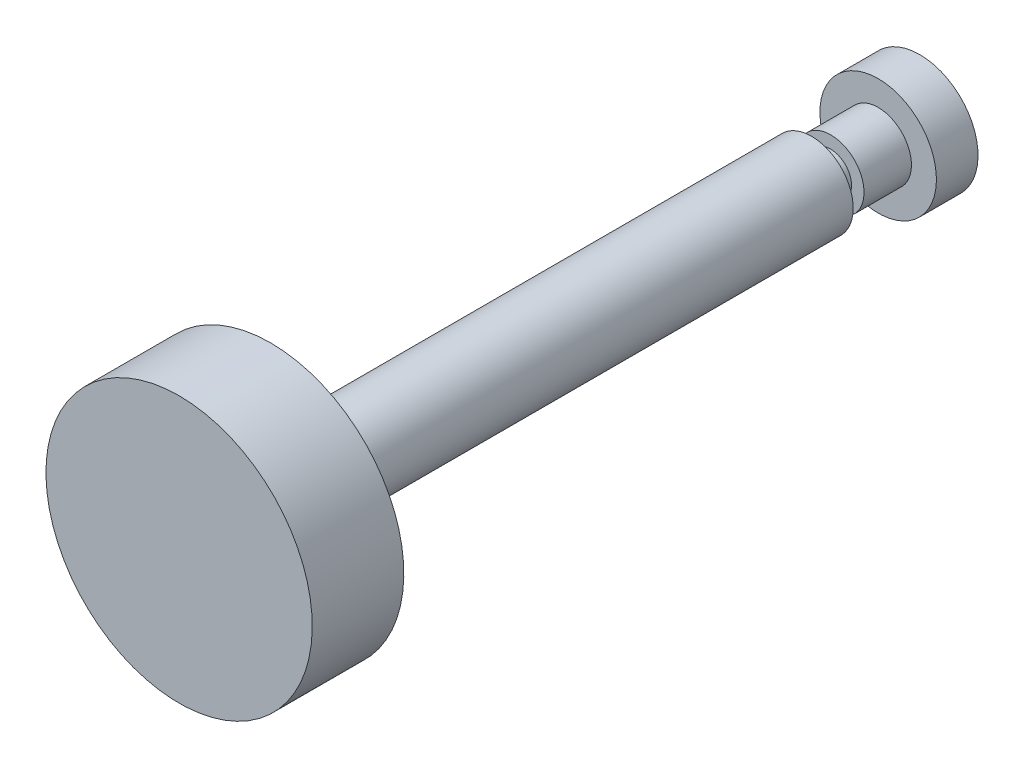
ISO-10303-21;
HEADER;
FILE_DESCRIPTION(('STEP AP214'),'2;1');
FILE_NAME('part.step','',(''),(''),'','','');
FILE_SCHEMA(('AUTOMOTIVE_DESIGN { 1 0 10303 214 1 1 1 1 }'));
ENDSEC;
DATA;
#1=APPLICATION_CONTEXT('core data for automotive mechanical design processes');
#2=APPLICATION_PROTOCOL_DEFINITION('international standard','automotive_design',2000,#1);
#3=PRODUCT_CONTEXT('',#1,'mechanical');
#4=PRODUCT('Part','Part','',(#3));
#5=PRODUCT_RELATED_PRODUCT_CATEGORY('part','',(#4));
#6=PRODUCT_DEFINITION_FORMATION('','',#4);
#7=PRODUCT_DEFINITION_CONTEXT('part definition',#1,'design');
#8=PRODUCT_DEFINITION('design','',#6,#7);
#9=PRODUCT_DEFINITION_SHAPE('','',#8);
#10=(LENGTH_UNIT() NAMED_UNIT(*) SI_UNIT(.MILLI.,.METRE.));
#11=(NAMED_UNIT(*) PLANE_ANGLE_UNIT() SI_UNIT($,.RADIAN.));
#12=(NAMED_UNIT(*) SI_UNIT($,.STERADIAN.) SOLID_ANGLE_UNIT());
#13=UNCERTAINTY_MEASURE_WITH_UNIT(LENGTH_MEASURE(1.E-05),#10,'distance_accuracy_value','');
#14=(GEOMETRIC_REPRESENTATION_CONTEXT(3) GLOBAL_UNCERTAINTY_ASSIGNED_CONTEXT((#13)) GLOBAL_UNIT_ASSIGNED_CONTEXT((#10,
#11,#12)) REPRESENTATION_CONTEXT('',''));
#15=CARTESIAN_POINT('',(0.,0.,0.));
#16=DIRECTION('',(0.,0.,1.));
#17=DIRECTION('',(1.,0.,0.));
#18=AXIS2_PLACEMENT_3D('',#15,#16,#17);
#19=CARTESIAN_POINT('',(0.,0.,0.));
#20=DIRECTION('',(0.,0.,1.));
#21=DIRECTION('',(0.,1.,0.));
#22=AXIS2_PLACEMENT_3D('',#19,#20,#21);
#23=PLANE('',#22);
#24=CARTESIAN_POINT('',(0.,0.,0.));
#25=DIRECTION('',(0.,0.,1.));
#26=DIRECTION('',(0.,1.,0.));
#27=AXIS2_PLACEMENT_3D('',#24,#25,#26);
#28=CIRCLE('',#27,7.);
#29=CARTESIAN_POINT('',(0.,7.,0.));
#30=VERTEX_POINT('',#29);
#31=EDGE_CURVE('E8',#30,#30,#28,.T.);
#32=ORIENTED_EDGE('',*,*,#31,.F.);
#33=EDGE_LOOP('',(#32));
#34=FACE_BOUND('',#33,.T.);
#35=ADVANCED_FACE('F12',(#34),#23,.F.);
#36=CARTESIAN_POINT('',(0.,0.,40.));
#37=DIRECTION('',(0.,0.,1.));
#38=DIRECTION('',(0.,1.,0.));
#39=AXIS2_PLACEMENT_3D('',#36,#37,#38);
#40=CYLINDRICAL_SURFACE('',#39,7.);
#41=CARTESIAN_POINT('',(0.,0.,5.));
#42=DIRECTION('',(0.,0.,1.));
#43=DIRECTION('',(0.,1.,0.));
#44=AXIS2_PLACEMENT_3D('',#41,#42,#43);
#45=CIRCLE('',#44,7.);
#46=CARTESIAN_POINT('',(0.,7.,5.));
#47=VERTEX_POINT('',#46);
#48=EDGE_CURVE('E18',#47,#47,#45,.T.);
#49=ORIENTED_EDGE('',*,*,#48,.F.);
#50=EDGE_LOOP('',(#49));
#51=FACE_BOUND('',#50,.T.);
#52=ORIENTED_EDGE('',*,*,#31,.T.);
#53=EDGE_LOOP('',(#52));
#54=FACE_BOUND('',#53,.T.);
#55=ADVANCED_FACE('F71',(#51,#54),#40,.T.);
#56=CARTESIAN_POINT('',(0.,-7.,5.));
#57=DIRECTION('',(0.,0.,-1.));
#58=DIRECTION('',(0.,-1.,0.));
#59=AXIS2_PLACEMENT_3D('',#56,#57,#58);
#60=PLANE('',#59);
#61=CARTESIAN_POINT('',(0.,0.,5.));
#62=DIRECTION('',(0.,0.,1.));
#63=DIRECTION('',(0.,1.,0.));
#64=AXIS2_PLACEMENT_3D('',#61,#62,#63);
#65=CIRCLE('',#64,4.);
#66=CARTESIAN_POINT('',(0.,4.,5.));
#67=VERTEX_POINT('',#66);
#68=EDGE_CURVE('E22',#67,#67,#65,.T.);
#69=ORIENTED_EDGE('',*,*,#68,.F.);
#70=EDGE_LOOP('',(#69));
#71=FACE_BOUND('',#70,.T.);
#72=ORIENTED_EDGE('',*,*,#48,.T.);
#73=EDGE_LOOP('',(#72));
#74=FACE_BOUND('',#73,.T.);
#75=ADVANCED_FACE('F76',(#71,#74),#60,.F.);
#76=CARTESIAN_POINT('',(0.,0.,40.));
#77=DIRECTION('',(0.,0.,1.));
#78=DIRECTION('',(0.,1.,0.));
#79=AXIS2_PLACEMENT_3D('',#76,#77,#78);
#80=CYLINDRICAL_SURFACE('',#79,4.);
#81=CARTESIAN_POINT('',(0.,0.,10.7));
#82=DIRECTION('',(0.,0.,1.));
#83=DIRECTION('',(0.,1.,0.));
#84=AXIS2_PLACEMENT_3D('',#81,#82,#83);
#85=CIRCLE('',#84,4.);
#86=CARTESIAN_POINT('',(0.,4.,10.7));
#87=VERTEX_POINT('',#86);
#88=EDGE_CURVE('E26',#87,#87,#85,.T.);
#89=ORIENTED_EDGE('',*,*,#88,.F.);
#90=EDGE_LOOP('',(#89));
#91=FACE_BOUND('',#90,.T.);
#92=ORIENTED_EDGE('',*,*,#68,.T.);
#93=EDGE_LOOP('',(#92));
#94=FACE_BOUND('',#93,.T.);
#95=ADVANCED_FACE('F81',(#91,#94),#80,.T.);
#96=CARTESIAN_POINT('',(0.,-4.,10.7));
#97=DIRECTION('',(0.,0.,-1.));
#98=DIRECTION('',(0.,-1.,0.));
#99=AXIS2_PLACEMENT_3D('',#96,#97,#98);
#100=PLANE('',#99);
#101=CARTESIAN_POINT('',(0.,0.,10.7));
#102=DIRECTION('',(0.,0.,1.));
#103=DIRECTION('',(0.,1.,0.));
#104=AXIS2_PLACEMENT_3D('',#101,#102,#103);
#105=CIRCLE('',#104,2.5);
#106=CARTESIAN_POINT('',(0.,2.5,10.7));
#107=VERTEX_POINT('',#106);
#108=EDGE_CURVE('E31',#107,#107,#105,.T.);
#109=ORIENTED_EDGE('',*,*,#108,.F.);
#110=EDGE_LOOP('',(#109));
#111=FACE_BOUND('',#110,.T.);
#112=ORIENTED_EDGE('',*,*,#88,.T.);
#113=EDGE_LOOP('',(#112));
#114=FACE_BOUND('',#113,.T.);
#115=ADVANCED_FACE('F87',(#111,#114),#100,.F.);
#116=CARTESIAN_POINT('',(0.,0.,40.));
#117=DIRECTION('',(0.,0.,1.));
#118=DIRECTION('',(0.,1.,0.));
#119=AXIS2_PLACEMENT_3D('',#116,#117,#118);
#120=CYLINDRICAL_SURFACE('',#119,2.5);
#121=CARTESIAN_POINT('',(0.,0.,13.));
#122=DIRECTION('',(0.,0.,1.));
#123=DIRECTION('',(0.,1.,0.));
#124=AXIS2_PLACEMENT_3D('',#121,#122,#123);
#125=CIRCLE('',#124,2.5);
#126=CARTESIAN_POINT('',(0.,2.5,13.));
#127=VERTEX_POINT('',#126);
#128=EDGE_CURVE('E34',#127,#127,#125,.T.);
#129=ORIENTED_EDGE('',*,*,#128,.F.);
#130=EDGE_LOOP('',(#129));
#131=FACE_BOUND('',#130,.T.);
#132=ORIENTED_EDGE('',*,*,#108,.T.);
#133=EDGE_LOOP('',(#132));
#134=FACE_BOUND('',#133,.T.);
#135=ADVANCED_FACE('F91',(#131,#134),#120,.T.);
#136=CARTESIAN_POINT('',(0.,-2.5,13.));
#137=DIRECTION('',(0.,0.,1.));
#138=DIRECTION('',(0.,1.,0.));
#139=AXIS2_PLACEMENT_3D('',#136,#137,#138);
#140=PLANE('',#139);
#141=CARTESIAN_POINT('',(0.,0.,13.));
#142=DIRECTION('',(0.,0.,1.));
#143=DIRECTION('',(0.,1.,0.));
#144=AXIS2_PLACEMENT_3D('',#141,#142,#143);
#145=CIRCLE('',#144,5.);
#146=CARTESIAN_POINT('',(0.,5.,13.));
#147=VERTEX_POINT('',#146);
#148=EDGE_CURVE('E37',#147,#147,#145,.T.);
#149=ORIENTED_EDGE('',*,*,#148,.F.);
#150=EDGE_LOOP('',(#149));
#151=FACE_BOUND('',#150,.T.);
#152=ORIENTED_EDGE('',*,*,#128,.T.);
#153=EDGE_LOOP('',(#152));
#154=FACE_BOUND('',#153,.T.);
#155=ADVANCED_FACE('F67',(#151,#154),#140,.F.);
#156=CARTESIAN_POINT('',(0.,0.,40.));
#157=DIRECTION('',(0.,0.,1.));
#158=DIRECTION('',(0.,1.,0.));
#159=AXIS2_PLACEMENT_3D('',#156,#157,#158);
#160=CYLINDRICAL_SURFACE('',#159,5.);
#161=CARTESIAN_POINT('',(0.,0.,78.));
#162=DIRECTION('',(0.,0.,1.));
#163=DIRECTION('',(0.,1.,0.));
#164=AXIS2_PLACEMENT_3D('',#161,#162,#163);
#165=CIRCLE('',#164,5.);
#166=CARTESIAN_POINT('',(0.,5.,78.));
#167=VERTEX_POINT('',#166);
#168=EDGE_CURVE('E40',#167,#167,#165,.T.);
#169=ORIENTED_EDGE('',*,*,#168,.F.);
#170=EDGE_LOOP('',(#169));
#171=FACE_BOUND('',#170,.T.);
#172=ORIENTED_EDGE('',*,*,#148,.T.);
#173=EDGE_LOOP('',(#172));
#174=FACE_BOUND('',#173,.T.);
#175=ADVANCED_FACE('F60',(#171,#174),#160,.T.);
#176=CARTESIAN_POINT('',(0.,-16.,78.));
#177=DIRECTION('',(0.,0.,-1.));
#178=DIRECTION('',(0.,-1.,0.));
#179=AXIS2_PLACEMENT_3D('',#176,#177,#178);
#180=PLANE('',#179);
#181=ORIENTED_EDGE('',*,*,#168,.T.);
#182=EDGE_LOOP('',(#181));
#183=FACE_BOUND('',#182,.T.);
#184=CARTESIAN_POINT('',(0.,0.,78.));
#185=DIRECTION('',(0.,0.,1.));
#186=DIRECTION('',(0.,1.,0.));
#187=AXIS2_PLACEMENT_3D('',#184,#185,#186);
#188=CIRCLE('',#187,16.);
#189=CARTESIAN_POINT('',(0.,16.,78.));
#190=VERTEX_POINT('',#189);
#191=EDGE_CURVE('E43',#190,#190,#188,.T.);
#192=ORIENTED_EDGE('',*,*,#191,.F.);
#193=EDGE_LOOP('',(#192));
#194=FACE_BOUND('',#193,.T.);
#195=ADVANCED_FACE('F55',(#183,#194),#180,.T.);
#196=CARTESIAN_POINT('',(0.,0.,40.));
#197=DIRECTION('',(0.,0.,1.));
#198=DIRECTION('',(0.,1.,0.));
#199=AXIS2_PLACEMENT_3D('',#196,#197,#198);
#200=CYLINDRICAL_SURFACE('',#199,16.);
#201=CARTESIAN_POINT('',(0.,0.,89.));
#202=DIRECTION('',(0.,0.,1.));
#203=DIRECTION('',(0.,1.,0.));
#204=AXIS2_PLACEMENT_3D('',#201,#202,#203);
#205=CIRCLE('',#204,16.);
#206=CARTESIAN_POINT('',(0.,16.,89.));
#207=VERTEX_POINT('',#206);
#208=EDGE_CURVE('E46',#207,#207,#205,.T.);
#209=ORIENTED_EDGE('',*,*,#208,.F.);
#210=EDGE_LOOP('',(#209));
#211=FACE_BOUND('',#210,.T.);
#212=ORIENTED_EDGE('',*,*,#191,.T.);
#213=EDGE_LOOP('',(#212));
#214=FACE_BOUND('',#213,.T.);
#215=ADVANCED_FACE('F52',(#211,#214),#200,.T.);
#216=CARTESIAN_POINT('',(0.,-16.,89.));
#217=DIRECTION('',(0.,0.,-1.));
#218=DIRECTION('',(0.,-1.,0.));
#219=AXIS2_PLACEMENT_3D('',#216,#217,#218);
#220=PLANE('',#219);
#221=ORIENTED_EDGE('',*,*,#208,.T.);
#222=EDGE_LOOP('',(#221));
#223=FACE_BOUND('',#222,.T.);
#224=ADVANCED_FACE('F50',(#223),#220,.F.);
#225=CLOSED_SHELL('',(#35,#55,#75,#95,#115,#135,#155,#175,#195,#215,#224));
#226=MANIFOLD_SOLID_BREP('B1',#225);
#227=ADVANCED_BREP_SHAPE_REPRESENTATION('',(#18,#226),#14);
#228=SHAPE_DEFINITION_REPRESENTATION(#9,#227);
ENDSEC;
END-ISO-10303-21;
